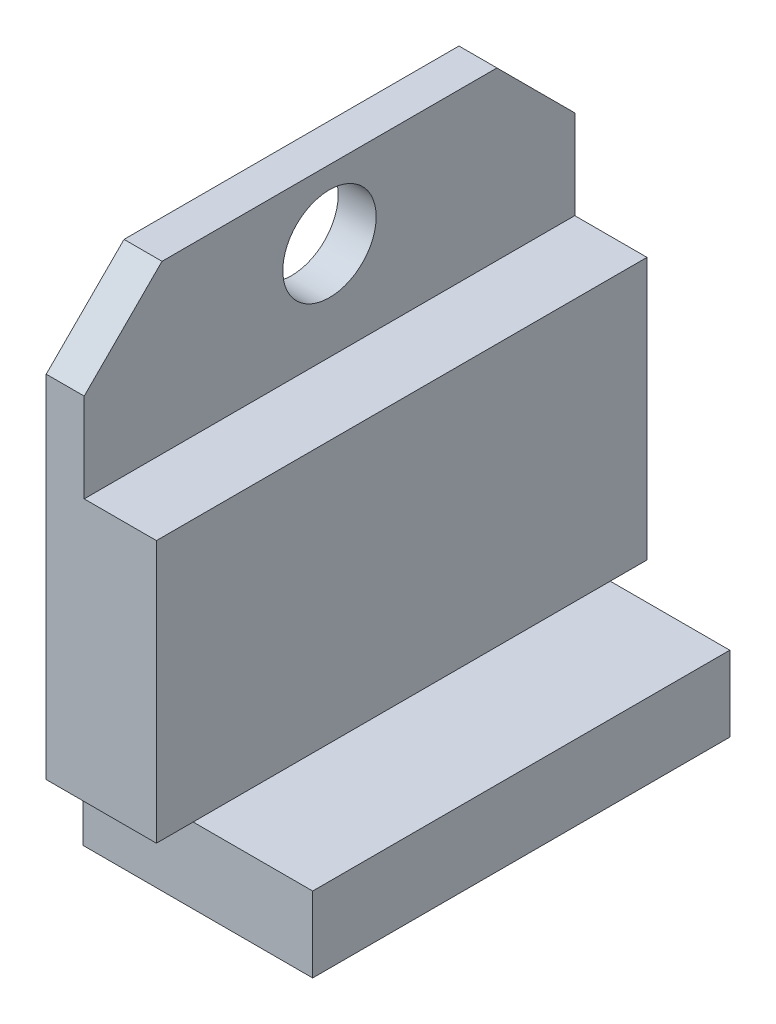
ISO-10303-21;
HEADER;
FILE_DESCRIPTION(('STEP AP214'),'2;1');
FILE_NAME('part.step','',(''),(''),'','','');
FILE_SCHEMA(('AUTOMOTIVE_DESIGN { 1 0 10303 214 1 1 1 1 }'));
ENDSEC;
DATA;
#1=APPLICATION_CONTEXT('core data for automotive mechanical design processes');
#2=APPLICATION_PROTOCOL_DEFINITION('international standard','automotive_design',2000,#1);
#3=PRODUCT_CONTEXT('',#1,'mechanical');
#4=PRODUCT('Part','Part','',(#3));
#5=PRODUCT_RELATED_PRODUCT_CATEGORY('part','',(#4));
#6=PRODUCT_DEFINITION_FORMATION('','',#4);
#7=PRODUCT_DEFINITION_CONTEXT('part definition',#1,'design');
#8=PRODUCT_DEFINITION('design','',#6,#7);
#9=PRODUCT_DEFINITION_SHAPE('','',#8);
#10=(LENGTH_UNIT() NAMED_UNIT(*) SI_UNIT(.MILLI.,.METRE.));
#11=(NAMED_UNIT(*) PLANE_ANGLE_UNIT() SI_UNIT($,.RADIAN.));
#12=(NAMED_UNIT(*) SI_UNIT($,.STERADIAN.) SOLID_ANGLE_UNIT());
#13=UNCERTAINTY_MEASURE_WITH_UNIT(LENGTH_MEASURE(1.E-05),#10,'distance_accuracy_value','');
#14=(GEOMETRIC_REPRESENTATION_CONTEXT(3) GLOBAL_UNCERTAINTY_ASSIGNED_CONTEXT((#13)) GLOBAL_UNIT_ASSIGNED_CONTEXT((#10,
#11,#12)) REPRESENTATION_CONTEXT('',''));
#15=CARTESIAN_POINT('',(0.,0.,0.));
#16=DIRECTION('',(0.,0.,1.));
#17=DIRECTION('',(1.,0.,0.));
#18=AXIS2_PLACEMENT_3D('',#15,#16,#17);
#19=CARTESIAN_POINT('',(1.5494,0.,0.));
#20=DIRECTION('',(0.,1.,0.));
#21=DIRECTION('',(0.,0.,1.));
#22=AXIS2_PLACEMENT_3D('',#19,#20,#21);
#23=PLANE('',#22);
#24=DIRECTION('',(-1.,0.,0.));
#25=VECTOR('',#24,1.);
#26=CARTESIAN_POINT('',(0.,0.,-1.4986));
#27=LINE('',#26,#25);
#28=CARTESIAN_POINT('',(4.4958,0.,-1.4986));
#29=VERTEX_POINT('',#28);
#30=CARTESIAN_POINT('',(0.,0.,-1.4986));
#31=VERTEX_POINT('',#30);
#32=EDGE_CURVE('E11',#29,#31,#27,.T.);
#33=ORIENTED_EDGE('',*,*,#32,.F.);
#34=DIRECTION('',(0.,0.,-1.));
#35=VECTOR('',#34,1.);
#36=CARTESIAN_POINT('',(4.4958,0.,0.));
#37=LINE('',#36,#35);
#38=CARTESIAN_POINT('',(4.4958,0.,0.));
#39=VERTEX_POINT('',#38);
#40=EDGE_CURVE('E281',#39,#29,#37,.T.);
#41=ORIENTED_EDGE('',*,*,#40,.F.);
#42=DIRECTION('',(-1.,0.,0.));
#43=VECTOR('',#42,1.);
#44=CARTESIAN_POINT('',(1.5494,0.,0.));
#45=LINE('',#44,#43);
#46=CARTESIAN_POINT('',(0.,0.,0.));
#47=VERTEX_POINT('',#46);
#48=EDGE_CURVE('E239',#39,#47,#45,.T.);
#49=ORIENTED_EDGE('',*,*,#48,.T.);
#50=DIRECTION('',(0.,0.,-1.));
#51=VECTOR('',#50,1.);
#52=CARTESIAN_POINT('',(0.,0.,0.));
#53=LINE('',#52,#51);
#54=EDGE_CURVE('E203',#47,#31,#53,.T.);
#55=ORIENTED_EDGE('',*,*,#54,.T.);
#56=EDGE_LOOP('',(#33,#41,#49,#55));
#57=FACE_BOUND('',#56,.T.);
#58=ADVANCED_FACE('F30',(#57),#23,.F.);
#59=DIRECTION('',(1.,0.,0.));
#60=VECTOR('',#59,1.);
#61=CARTESIAN_POINT('',(0.,0.,-18.5166));
#62=LINE('',#61,#60);
#63=CARTESIAN_POINT('',(0.,0.,-18.5166));
#64=VERTEX_POINT('',#63);
#65=CARTESIAN_POINT('',(4.4958,0.,-18.5166));
#66=VERTEX_POINT('',#65);
#67=EDGE_CURVE('E53',#64,#66,#62,.T.);
#68=ORIENTED_EDGE('',*,*,#67,.F.);
#69=CARTESIAN_POINT('',(0.,0.,-20.0152));
#70=VERTEX_POINT('',#69);
#71=EDGE_CURVE('E159',#64,#70,#53,.T.);
#72=ORIENTED_EDGE('',*,*,#71,.T.);
#73=DIRECTION('',(-1.,0.,0.));
#74=VECTOR('',#73,1.);
#75=CARTESIAN_POINT('',(1.5494,0.,-20.0152));
#76=LINE('',#75,#74);
#77=CARTESIAN_POINT('',(4.4958,0.,-20.0152));
#78=VERTEX_POINT('',#77);
#79=EDGE_CURVE('E242',#78,#70,#76,.T.);
#80=ORIENTED_EDGE('',*,*,#79,.F.);
#81=EDGE_CURVE('E285',#66,#78,#37,.T.);
#82=ORIENTED_EDGE('',*,*,#81,.F.);
#83=EDGE_LOOP('',(#68,#72,#80,#82));
#84=FACE_BOUND('',#83,.T.);
#85=ADVANCED_FACE('F292',(#84),#23,.F.);
#86=CARTESIAN_POINT('',(1.5494,17.5006,0.));
#87=DIRECTION('',(-1.,0.,0.));
#88=DIRECTION('',(0.,0.,1.));
#89=AXIS2_PLACEMENT_3D('',#86,#87,#88);
#90=PLANE('',#89);
#91=CARTESIAN_POINT('',(1.5494,14.7066,-10.0076));
#92=DIRECTION('',(1.,0.,0.));
#93=DIRECTION('',(0.,0.,-1.));
#94=AXIS2_PLACEMENT_3D('',#91,#92,#93);
#95=CIRCLE('',#94,1.905);
#96=CARTESIAN_POINT('',(1.5494,14.7066,-11.9126));
#97=VERTEX_POINT('',#96);
#98=EDGE_CURVE('E288',#97,#97,#95,.T.);
#99=ORIENTED_EDGE('',*,*,#98,.F.);
#100=EDGE_LOOP('',(#99));
#101=FACE_BOUND('',#100,.T.);
#102=DIRECTION('',(0.,0.,1.));
#103=VECTOR('',#102,1.);
#104=CARTESIAN_POINT('',(1.5494,10.6934,0.));
#105=LINE('',#104,#103);
#106=CARTESIAN_POINT('',(1.5494,10.6934,-20.0152));
#107=VERTEX_POINT('',#106);
#108=CARTESIAN_POINT('',(1.5494,10.6934,0.));
#109=VERTEX_POINT('',#108);
#110=EDGE_CURVE('E164',#107,#109,#105,.T.);
#111=ORIENTED_EDGE('',*,*,#110,.F.);
#112=DIRECTION('',(0.,1.,0.));
#113=VECTOR('',#112,1.);
#114=CARTESIAN_POINT('',(1.5494,0.,-20.0152));
#115=LINE('',#114,#113);
#116=CARTESIAN_POINT('',(1.5494,14.3256,-20.0152));
#117=VERTEX_POINT('',#116);
#118=EDGE_CURVE('E189',#107,#117,#115,.T.);
#119=ORIENTED_EDGE('',*,*,#118,.T.);
#120=DIRECTION('',(0.,-0.707106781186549,-0.707106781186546));
#121=VECTOR('',#120,1.);
#122=CARTESIAN_POINT('',(1.5494,17.5006,-16.8402));
#123=LINE('',#122,#121);
#124=CARTESIAN_POINT('',(1.5494,17.5006,-16.8402));
#125=VERTEX_POINT('',#124);
#126=EDGE_CURVE('E225',#117,#125,#123,.F.);
#127=ORIENTED_EDGE('',*,*,#126,.T.);
#128=DIRECTION('',(0.,0.,1.));
#129=VECTOR('',#128,1.);
#130=CARTESIAN_POINT('',(1.5494,17.5006,0.));
#131=LINE('',#130,#129);
#132=CARTESIAN_POINT('',(1.5494,17.5006,-3.17500000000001));
#133=VERTEX_POINT('',#132);
#134=EDGE_CURVE('E244',#125,#133,#131,.T.);
#135=ORIENTED_EDGE('',*,*,#134,.T.);
#136=DIRECTION('',(0.,0.707106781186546,-0.707106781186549));
#137=VECTOR('',#136,1.);
#138=CARTESIAN_POINT('',(1.5494,14.3256,0.));
#139=LINE('',#138,#137);
#140=CARTESIAN_POINT('',(1.5494,14.3256,0.));
#141=VERTEX_POINT('',#140);
#142=EDGE_CURVE('E223',#133,#141,#139,.F.);
#143=ORIENTED_EDGE('',*,*,#142,.T.);
#144=DIRECTION('',(0.,-1.,0.));
#145=VECTOR('',#144,1.);
#146=CARTESIAN_POINT('',(1.5494,0.,0.));
#147=LINE('',#146,#145);
#148=EDGE_CURVE('E216',#141,#109,#147,.T.);
#149=ORIENTED_EDGE('',*,*,#148,.T.);
#150=EDGE_LOOP('',(#111,#119,#127,#135,#143,#149));
#151=FACE_BOUND('',#150,.T.);
#152=ADVANCED_FACE('F250',(#101,#151),#90,.F.);
#153=CARTESIAN_POINT('',(0.,17.5006,0.));
#154=DIRECTION('',(-1.,0.,0.));
#155=DIRECTION('',(0.,0.,1.));
#156=AXIS2_PLACEMENT_3D('',#153,#154,#155);
#157=PLANE('',#156);
#158=DIRECTION('',(0.,-1.,0.));
#159=VECTOR('',#158,1.);
#160=CARTESIAN_POINT('',(0.,0.,0.));
#161=LINE('',#160,#159);
#162=CARTESIAN_POINT('',(0.,14.3256,0.));
#163=VERTEX_POINT('',#162);
#164=EDGE_CURVE('E208',#163,#47,#161,.T.);
#165=ORIENTED_EDGE('',*,*,#164,.F.);
#166=DIRECTION('',(0.,-0.707106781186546,0.707106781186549));
#167=VECTOR('',#166,1.);
#168=CARTESIAN_POINT('',(0.,15.9131,-1.5875));
#169=LINE('',#168,#167);
#170=CARTESIAN_POINT('',(0.,17.5006,-3.17500000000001));
#171=VERTEX_POINT('',#170);
#172=EDGE_CURVE('E232',#163,#171,#169,.F.);
#173=ORIENTED_EDGE('',*,*,#172,.T.);
#174=DIRECTION('',(0.,0.,1.));
#175=VECTOR('',#174,1.);
#176=CARTESIAN_POINT('',(0.,17.5006,0.));
#177=LINE('',#176,#175);
#178=CARTESIAN_POINT('',(0.,17.5006,-16.8402));
#179=VERTEX_POINT('',#178);
#180=EDGE_CURVE('E213',#179,#171,#177,.T.);
#181=ORIENTED_EDGE('',*,*,#180,.F.);
#182=DIRECTION('',(0.,0.707106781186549,0.707106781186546));
#183=VECTOR('',#182,1.);
#184=CARTESIAN_POINT('',(0.,25.9207,-8.42010000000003));
#185=LINE('',#184,#183);
#186=CARTESIAN_POINT('',(0.,14.3256,-20.0152));
#187=VERTEX_POINT('',#186);
#188=EDGE_CURVE('E234',#179,#187,#185,.F.);
#189=ORIENTED_EDGE('',*,*,#188,.T.);
#190=DIRECTION('',(0.,1.,0.));
#191=VECTOR('',#190,1.);
#192=CARTESIAN_POINT('',(0.,0.,-20.0152));
#193=LINE('',#192,#191);
#194=EDGE_CURVE('E204',#70,#187,#193,.T.);
#195=ORIENTED_EDGE('',*,*,#194,.F.);
#196=ORIENTED_EDGE('',*,*,#71,.F.);
#197=DIRECTION('',(0.,1.,0.));
#198=VECTOR('',#197,1.);
#199=CARTESIAN_POINT('',(0.,-3.0734,-18.5166));
#200=LINE('',#199,#198);
#201=CARTESIAN_POINT('',(0.,-3.0734,-18.5166));
#202=VERTEX_POINT('',#201);
#203=EDGE_CURVE('E143',#202,#64,#200,.T.);
#204=ORIENTED_EDGE('',*,*,#203,.F.);
#205=DIRECTION('',(0.,0.,-1.));
#206=VECTOR('',#205,1.);
#207=CARTESIAN_POINT('',(0.,-3.0734,-1.4986));
#208=LINE('',#207,#206);
#209=CARTESIAN_POINT('',(0.,-3.0734,-1.4986));
#210=VERTEX_POINT('',#209);
#211=EDGE_CURVE('E151',#210,#202,#208,.T.);
#212=ORIENTED_EDGE('',*,*,#211,.F.);
#213=DIRECTION('',(0.,1.,0.));
#214=VECTOR('',#213,1.);
#215=CARTESIAN_POINT('',(0.,-3.0734,-1.4986));
#216=LINE('',#215,#214);
#217=EDGE_CURVE('E166',#210,#31,#216,.T.);
#218=ORIENTED_EDGE('',*,*,#217,.T.);
#219=ORIENTED_EDGE('',*,*,#54,.F.);
#220=EDGE_LOOP('',(#165,#173,#181,#189,#195,#196,#204,#212,#218,#219));
#221=FACE_BOUND('',#220,.T.);
#222=CARTESIAN_POINT('',(0.,14.7066,-10.0076));
#223=DIRECTION('',(1.,0.,0.));
#224=DIRECTION('',(0.,0.,-1.));
#225=AXIS2_PLACEMENT_3D('',#222,#223,#224);
#226=CIRCLE('',#225,1.905);
#227=CARTESIAN_POINT('',(0.,14.7066,-11.9126));
#228=VERTEX_POINT('',#227);
#229=EDGE_CURVE('E201',#228,#228,#226,.T.);
#230=ORIENTED_EDGE('',*,*,#229,.T.);
#231=EDGE_LOOP('',(#230));
#232=FACE_BOUND('',#231,.T.);
#233=ADVANCED_FACE('F265',(#221,#232),#157,.T.);
#234=CARTESIAN_POINT('',(1.5494,0.,0.));
#235=DIRECTION('',(0.,0.,-1.));
#236=DIRECTION('',(-1.,0.,0.));
#237=AXIS2_PLACEMENT_3D('',#234,#235,#236);
#238=PLANE('',#237);
#239=ORIENTED_EDGE('',*,*,#148,.F.);
#240=DIRECTION('',(-1.,0.,0.));
#241=VECTOR('',#240,1.);
#242=CARTESIAN_POINT('',(1.5494,14.3256,0.));
#243=LINE('',#242,#241);
#244=EDGE_CURVE('E236',#141,#163,#243,.T.);
#245=ORIENTED_EDGE('',*,*,#244,.T.);
#246=ORIENTED_EDGE('',*,*,#164,.T.);
#247=ORIENTED_EDGE('',*,*,#48,.F.);
#248=DIRECTION('',(0.,-1.,0.));
#249=VECTOR('',#248,1.);
#250=CARTESIAN_POINT('',(4.4958,0.,0.));
#251=LINE('',#250,#249);
#252=CARTESIAN_POINT('',(4.4958,10.6934,0.));
#253=VERTEX_POINT('',#252);
#254=EDGE_CURVE('E183',#253,#39,#251,.T.);
#255=ORIENTED_EDGE('',*,*,#254,.F.);
#256=DIRECTION('',(-1.,0.,0.));
#257=VECTOR('',#256,1.);
#258=CARTESIAN_POINT('',(4.4958,10.6934,0.));
#259=LINE('',#258,#257);
#260=EDGE_CURVE('E192',#253,#109,#259,.T.);
#261=ORIENTED_EDGE('',*,*,#260,.T.);
#262=EDGE_LOOP('',(#239,#245,#246,#247,#255,#261));
#263=FACE_BOUND('',#262,.T.);
#264=ADVANCED_FACE('F32',(#263),#238,.F.);
#265=CARTESIAN_POINT('',(1.5494,0.,-20.0152));
#266=DIRECTION('',(0.,0.,1.));
#267=DIRECTION('',(1.,0.,0.));
#268=AXIS2_PLACEMENT_3D('',#265,#266,#267);
#269=PLANE('',#268);
#270=ORIENTED_EDGE('',*,*,#194,.T.);
#271=DIRECTION('',(1.,0.,0.));
#272=VECTOR('',#271,1.);
#273=CARTESIAN_POINT('',(1.5494,14.3256,-20.0152));
#274=LINE('',#273,#272);
#275=EDGE_CURVE('E39',#187,#117,#274,.T.);
#276=ORIENTED_EDGE('',*,*,#275,.T.);
#277=ORIENTED_EDGE('',*,*,#118,.F.);
#278=DIRECTION('',(-1.,0.,0.));
#279=VECTOR('',#278,1.);
#280=CARTESIAN_POINT('',(4.4958,10.6934,-20.0152));
#281=LINE('',#280,#279);
#282=CARTESIAN_POINT('',(4.4958,10.6934,-20.0152));
#283=VERTEX_POINT('',#282);
#284=EDGE_CURVE('E195',#283,#107,#281,.T.);
#285=ORIENTED_EDGE('',*,*,#284,.F.);
#286=DIRECTION('',(0.,1.,0.));
#287=VECTOR('',#286,1.);
#288=CARTESIAN_POINT('',(4.4958,0.,-20.0152));
#289=LINE('',#288,#287);
#290=EDGE_CURVE('E278',#78,#283,#289,.T.);
#291=ORIENTED_EDGE('',*,*,#290,.F.);
#292=ORIENTED_EDGE('',*,*,#79,.T.);
#293=EDGE_LOOP('',(#270,#276,#277,#285,#291,#292));
#294=FACE_BOUND('',#293,.T.);
#295=ADVANCED_FACE('F255',(#294),#269,.F.);
#296=CARTESIAN_POINT('',(1.5494,17.5006,0.));
#297=DIRECTION('',(0.,-1.,0.));
#298=DIRECTION('',(0.,0.,-1.));
#299=AXIS2_PLACEMENT_3D('',#296,#297,#298);
#300=PLANE('',#299);
#301=ORIENTED_EDGE('',*,*,#180,.T.);
#302=DIRECTION('',(1.,0.,0.));
#303=VECTOR('',#302,1.);
#304=CARTESIAN_POINT('',(1.5494,17.5006,-3.17500000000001));
#305=LINE('',#304,#303);
#306=EDGE_CURVE('E227',#171,#133,#305,.T.);
#307=ORIENTED_EDGE('',*,*,#306,.T.);
#308=ORIENTED_EDGE('',*,*,#134,.F.);
#309=DIRECTION('',(-1.,0.,0.));
#310=VECTOR('',#309,1.);
#311=CARTESIAN_POINT('',(1.5494,17.5006,-16.8402));
#312=LINE('',#311,#310);
#313=EDGE_CURVE('E229',#125,#179,#312,.T.);
#314=ORIENTED_EDGE('',*,*,#313,.T.);
#315=EDGE_LOOP('',(#301,#307,#308,#314));
#316=FACE_BOUND('',#315,.T.);
#317=ADVANCED_FACE('F262',(#316),#300,.F.);
#318=CARTESIAN_POINT('',(1.5494,14.7066,-10.0076));
#319=DIRECTION('',(-1.,0.,0.));
#320=DIRECTION('',(0.,0.,1.));
#321=AXIS2_PLACEMENT_3D('',#318,#319,#320);
#322=CYLINDRICAL_SURFACE('',#321,1.905);
#323=ORIENTED_EDGE('',*,*,#98,.T.);
#324=EDGE_LOOP('',(#323));
#325=FACE_BOUND('',#324,.T.);
#326=ORIENTED_EDGE('',*,*,#229,.F.);
#327=EDGE_LOOP('',(#326));
#328=FACE_BOUND('',#327,.T.);
#329=ADVANCED_FACE('F314',(#325,#328),#322,.F.);
#330=CARTESIAN_POINT('',(1.5494,14.3256,0.));
#331=DIRECTION('',(0.,-0.707106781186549,-0.707106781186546));
#332=DIRECTION('',(0.,0.707106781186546,-0.707106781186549));
#333=AXIS2_PLACEMENT_3D('',#330,#331,#332);
#334=PLANE('',#333);
#335=ORIENTED_EDGE('',*,*,#142,.F.);
#336=ORIENTED_EDGE('',*,*,#306,.F.);
#337=ORIENTED_EDGE('',*,*,#172,.F.);
#338=ORIENTED_EDGE('',*,*,#244,.F.);
#339=EDGE_LOOP('',(#335,#336,#337,#338));
#340=FACE_BOUND('',#339,.T.);
#341=ADVANCED_FACE('F269',(#340),#334,.F.);
#342=CARTESIAN_POINT('',(1.5494,17.5006,-16.8402));
#343=DIRECTION('',(0.,-0.707106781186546,0.707106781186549));
#344=DIRECTION('',(0.,-0.707106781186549,-0.707106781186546));
#345=AXIS2_PLACEMENT_3D('',#342,#343,#344);
#346=PLANE('',#345);
#347=ORIENTED_EDGE('',*,*,#126,.F.);
#348=ORIENTED_EDGE('',*,*,#275,.F.);
#349=ORIENTED_EDGE('',*,*,#188,.F.);
#350=ORIENTED_EDGE('',*,*,#313,.F.);
#351=EDGE_LOOP('',(#347,#348,#349,#350));
#352=FACE_BOUND('',#351,.T.);
#353=ADVANCED_FACE('F259',(#352),#346,.F.);
#354=CARTESIAN_POINT('',(4.4958,10.6934,0.));
#355=DIRECTION('',(0.,-1.,0.));
#356=DIRECTION('',(0.,0.,-1.));
#357=AXIS2_PLACEMENT_3D('',#354,#355,#356);
#358=PLANE('',#357);
#359=ORIENTED_EDGE('',*,*,#110,.T.);
#360=ORIENTED_EDGE('',*,*,#260,.F.);
#361=DIRECTION('',(0.,0.,1.));
#362=VECTOR('',#361,1.);
#363=CARTESIAN_POINT('',(4.4958,10.6934,0.));
#364=LINE('',#363,#362);
#365=EDGE_CURVE('E196',#283,#253,#364,.T.);
#366=ORIENTED_EDGE('',*,*,#365,.F.);
#367=ORIENTED_EDGE('',*,*,#284,.T.);
#368=EDGE_LOOP('',(#359,#360,#366,#367));
#369=FACE_BOUND('',#368,.T.);
#370=ADVANCED_FACE('F275',(#369),#358,.F.);
#371=CARTESIAN_POINT('',(4.4958,10.6934,0.));
#372=DIRECTION('',(-1.,0.,0.));
#373=DIRECTION('',(0.,0.,1.));
#374=AXIS2_PLACEMENT_3D('',#371,#372,#373);
#375=PLANE('',#374);
#376=ORIENTED_EDGE('',*,*,#254,.T.);
#377=ORIENTED_EDGE('',*,*,#40,.T.);
#378=EDGE_CURVE('E284',#29,#66,#37,.T.);
#379=ORIENTED_EDGE('',*,*,#378,.T.);
#380=ORIENTED_EDGE('',*,*,#81,.T.);
#381=ORIENTED_EDGE('',*,*,#290,.T.);
#382=ORIENTED_EDGE('',*,*,#365,.T.);
#383=EDGE_LOOP('',(#376,#377,#379,#380,#381,#382));
#384=FACE_BOUND('',#383,.T.);
#385=ADVANCED_FACE('F328',(#384),#375,.F.);
#386=CARTESIAN_POINT('',(0.,-3.0734,-18.5166));
#387=DIRECTION('',(0.,0.,1.));
#388=DIRECTION('',(1.,0.,0.));
#389=AXIS2_PLACEMENT_3D('',#386,#387,#388);
#390=PLANE('',#389);
#391=ORIENTED_EDGE('',*,*,#67,.T.);
#392=CARTESIAN_POINT('',(9.3726,0.,-18.5166));
#393=VERTEX_POINT('',#392);
#394=EDGE_CURVE('E127',#66,#393,#62,.T.);
#395=ORIENTED_EDGE('',*,*,#394,.T.);
#396=DIRECTION('',(0.,1.,0.));
#397=VECTOR('',#396,1.);
#398=CARTESIAN_POINT('',(9.3726,-3.0734,-18.5166));
#399=LINE('',#398,#397);
#400=CARTESIAN_POINT('',(9.3726,-3.0734,-18.5166));
#401=VERTEX_POINT('',#400);
#402=EDGE_CURVE('E130',#401,#393,#399,.T.);
#403=ORIENTED_EDGE('',*,*,#402,.F.);
#404=DIRECTION('',(1.,0.,0.));
#405=VECTOR('',#404,1.);
#406=CARTESIAN_POINT('',(0.,-3.0734,-18.5166));
#407=LINE('',#406,#405);
#408=EDGE_CURVE('E178',#202,#401,#407,.T.);
#409=ORIENTED_EDGE('',*,*,#408,.F.);
#410=ORIENTED_EDGE('',*,*,#203,.T.);
#411=EDGE_LOOP('',(#391,#395,#403,#409,#410));
#412=FACE_BOUND('',#411,.T.);
#413=ADVANCED_FACE('F129',(#412),#390,.F.);
#414=CARTESIAN_POINT('',(9.3726,-3.0734,-1.4986));
#415=DIRECTION('',(-1.,0.,0.));
#416=DIRECTION('',(0.,0.,1.));
#417=AXIS2_PLACEMENT_3D('',#414,#415,#416);
#418=PLANE('',#417);
#419=DIRECTION('',(0.,0.,1.));
#420=VECTOR('',#419,1.);
#421=CARTESIAN_POINT('',(9.3726,0.,-1.4986));
#422=LINE('',#421,#420);
#423=CARTESIAN_POINT('',(9.3726,0.,-1.4986));
#424=VERTEX_POINT('',#423);
#425=EDGE_CURVE('E140',#393,#424,#422,.T.);
#426=ORIENTED_EDGE('',*,*,#425,.T.);
#427=DIRECTION('',(0.,1.,0.));
#428=VECTOR('',#427,1.);
#429=CARTESIAN_POINT('',(9.3726,-3.0734,-1.4986));
#430=LINE('',#429,#428);
#431=CARTESIAN_POINT('',(9.3726,-3.0734,-1.4986));
#432=VERTEX_POINT('',#431);
#433=EDGE_CURVE('E144',#432,#424,#430,.T.);
#434=ORIENTED_EDGE('',*,*,#433,.F.);
#435=DIRECTION('',(0.,0.,1.));
#436=VECTOR('',#435,1.);
#437=CARTESIAN_POINT('',(9.3726,-3.0734,-1.4986));
#438=LINE('',#437,#436);
#439=EDGE_CURVE('E142',#401,#432,#438,.T.);
#440=ORIENTED_EDGE('',*,*,#439,.F.);
#441=ORIENTED_EDGE('',*,*,#402,.T.);
#442=EDGE_LOOP('',(#426,#434,#440,#441));
#443=FACE_BOUND('',#442,.T.);
#444=ADVANCED_FACE('F138',(#443),#418,.F.);
#445=CARTESIAN_POINT('',(0.,-3.0734,-1.4986));
#446=DIRECTION('',(0.,0.,-1.));
#447=DIRECTION('',(-1.,0.,0.));
#448=AXIS2_PLACEMENT_3D('',#445,#446,#447);
#449=PLANE('',#448);
#450=EDGE_CURVE('E149',#424,#29,#27,.T.);
#451=ORIENTED_EDGE('',*,*,#450,.T.);
#452=ORIENTED_EDGE('',*,*,#32,.T.);
#453=ORIENTED_EDGE('',*,*,#217,.F.);
#454=DIRECTION('',(-1.,0.,0.));
#455=VECTOR('',#454,1.);
#456=CARTESIAN_POINT('',(0.,-3.0734,-1.4986));
#457=LINE('',#456,#455);
#458=EDGE_CURVE('E168',#432,#210,#457,.T.);
#459=ORIENTED_EDGE('',*,*,#458,.F.);
#460=ORIENTED_EDGE('',*,*,#433,.T.);
#461=EDGE_LOOP('',(#451,#452,#453,#459,#460));
#462=FACE_BOUND('',#461,.T.);
#463=ADVANCED_FACE('F296',(#462),#449,.F.);
#464=CARTESIAN_POINT('',(0.,-3.0734,-18.5166));
#465=DIRECTION('',(0.,-1.,0.));
#466=DIRECTION('',(0.,0.,-1.));
#467=AXIS2_PLACEMENT_3D('',#464,#465,#466);
#468=PLANE('',#467);
#469=ORIENTED_EDGE('',*,*,#211,.T.);
#470=ORIENTED_EDGE('',*,*,#408,.T.);
#471=ORIENTED_EDGE('',*,*,#439,.T.);
#472=ORIENTED_EDGE('',*,*,#458,.T.);
#473=EDGE_LOOP('',(#469,#470,#471,#472));
#474=FACE_BOUND('',#473,.T.);
#475=ADVANCED_FACE('F294',(#474),#468,.T.);
#476=CARTESIAN_POINT('',(0.,0.,-18.5166));
#477=DIRECTION('',(0.,-1.,0.));
#478=DIRECTION('',(0.,0.,-1.));
#479=AXIS2_PLACEMENT_3D('',#476,#477,#478);
#480=PLANE('',#479);
#481=ORIENTED_EDGE('',*,*,#378,.F.);
#482=ORIENTED_EDGE('',*,*,#450,.F.);
#483=ORIENTED_EDGE('',*,*,#425,.F.);
#484=ORIENTED_EDGE('',*,*,#394,.F.);
#485=EDGE_LOOP('',(#481,#482,#483,#484));
#486=FACE_BOUND('',#485,.T.);
#487=ADVANCED_FACE('F147',(#486),#480,.F.);
#488=CLOSED_SHELL('',(#58,#85,#152,#233,#264,#295,#317,#329,#341,#353,#370,#385,#413,#444,#463,
#475,#487));
#489=MANIFOLD_SOLID_BREP('B2',#488);
#490=ADVANCED_BREP_SHAPE_REPRESENTATION('',(#18,#489),#14);
#491=SHAPE_DEFINITION_REPRESENTATION(#9,#490);
ENDSEC;
END-ISO-10303-21;
